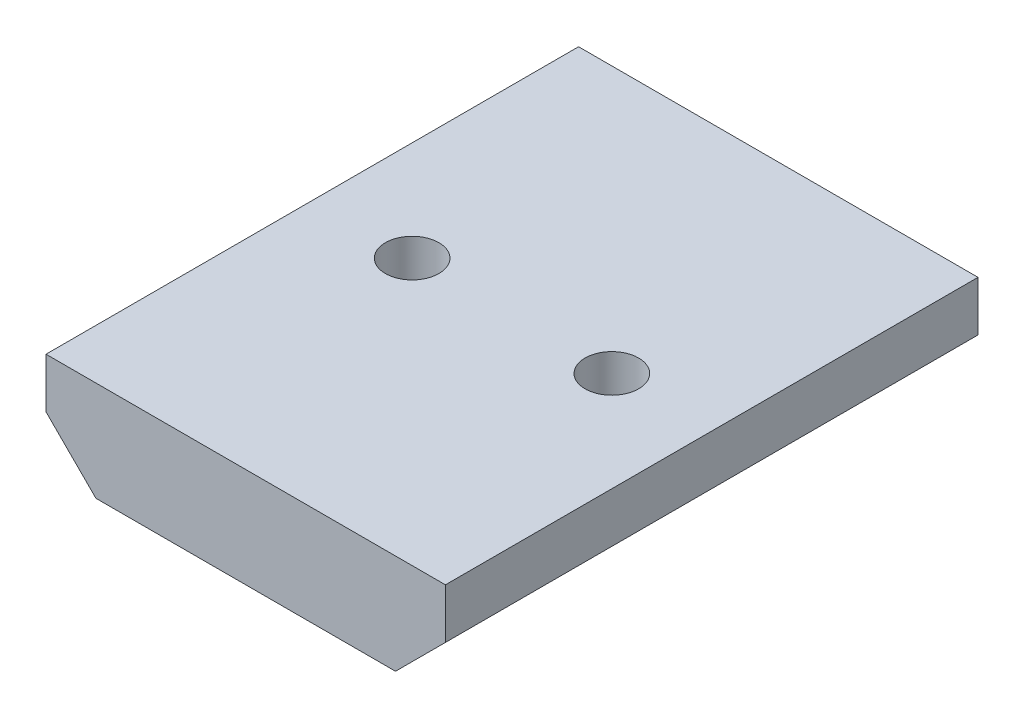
ISO-10303-21;
HEADER;
FILE_DESCRIPTION(('STEP AP214'),'2;1');
FILE_NAME('part.step','',(''),(''),'','','');
FILE_SCHEMA(('AUTOMOTIVE_DESIGN { 1 0 10303 214 1 1 1 1 }'));
ENDSEC;
DATA;
#1=APPLICATION_CONTEXT('core data for automotive mechanical design processes');
#2=APPLICATION_PROTOCOL_DEFINITION('international standard','automotive_design',2000,#1);
#3=PRODUCT_CONTEXT('',#1,'mechanical');
#4=PRODUCT('Part','Part','',(#3));
#5=PRODUCT_RELATED_PRODUCT_CATEGORY('part','',(#4));
#6=PRODUCT_DEFINITION_FORMATION('','',#4);
#7=PRODUCT_DEFINITION_CONTEXT('part definition',#1,'design');
#8=PRODUCT_DEFINITION('design','',#6,#7);
#9=PRODUCT_DEFINITION_SHAPE('','',#8);
#10=(LENGTH_UNIT() NAMED_UNIT(*) SI_UNIT(.MILLI.,.METRE.));
#11=(NAMED_UNIT(*) PLANE_ANGLE_UNIT() SI_UNIT($,.RADIAN.));
#12=(NAMED_UNIT(*) SI_UNIT($,.STERADIAN.) SOLID_ANGLE_UNIT());
#13=UNCERTAINTY_MEASURE_WITH_UNIT(LENGTH_MEASURE(1.E-05),#10,'distance_accuracy_value','');
#14=(GEOMETRIC_REPRESENTATION_CONTEXT(3) GLOBAL_UNCERTAINTY_ASSIGNED_CONTEXT((#13)) GLOBAL_UNIT_ASSIGNED_CONTEXT((#10,
#11,#12)) REPRESENTATION_CONTEXT('',''));
#15=CARTESIAN_POINT('',(0.,0.,0.));
#16=DIRECTION('',(0.,0.,1.));
#17=DIRECTION('',(1.,0.,0.));
#18=AXIS2_PLACEMENT_3D('',#15,#16,#17);
#19=CARTESIAN_POINT('',(19.05,4.7625,-25.4));
#20=DIRECTION('',(-1.,0.,0.));
#21=DIRECTION('',(0.,0.,1.));
#22=AXIS2_PLACEMENT_3D('',#19,#20,#21);
#23=PLANE('',#22);
#24=DIRECTION('',(0.,-1.,0.));
#25=VECTOR('',#24,1.);
#26=CARTESIAN_POINT('',(19.05,4.7625,25.4));
#27=LINE('',#26,#25);
#28=CARTESIAN_POINT('',(19.05,4.7625,25.4));
#29=VERTEX_POINT('',#28);
#30=CARTESIAN_POINT('',(19.05,0.,25.4));
#31=VERTEX_POINT('',#30);
#32=EDGE_CURVE('E140',#29,#31,#27,.T.);
#33=ORIENTED_EDGE('',*,*,#32,.T.);
#34=DIRECTION('',(0.,0.,-1.));
#35=VECTOR('',#34,1.);
#36=CARTESIAN_POINT('',(19.05,0.,-25.4));
#37=LINE('',#36,#35);
#38=CARTESIAN_POINT('',(19.05,0.,-25.4));
#39=VERTEX_POINT('',#38);
#40=EDGE_CURVE('E119',#31,#39,#37,.T.);
#41=ORIENTED_EDGE('',*,*,#40,.T.);
#42=DIRECTION('',(0.,-1.,0.));
#43=VECTOR('',#42,1.);
#44=CARTESIAN_POINT('',(19.05,4.7625,-25.4));
#45=LINE('',#44,#43);
#46=CARTESIAN_POINT('',(19.05,4.7625,-25.4));
#47=VERTEX_POINT('',#46);
#48=EDGE_CURVE('E100',#47,#39,#45,.T.);
#49=ORIENTED_EDGE('',*,*,#48,.F.);
#50=DIRECTION('',(0.,0.,-1.));
#51=VECTOR('',#50,1.);
#52=CARTESIAN_POINT('',(19.05,4.7625,-25.4));
#53=LINE('',#52,#51);
#54=EDGE_CURVE('E106',#29,#47,#53,.T.);
#55=ORIENTED_EDGE('',*,*,#54,.F.);
#56=EDGE_LOOP('',(#33,#41,#49,#55));
#57=FACE_BOUND('',#56,.T.);
#58=ADVANCED_FACE('F35',(#57),#23,.F.);
#59=CARTESIAN_POINT('',(-19.05,4.7625,-25.4));
#60=DIRECTION('',(0.,0.,1.));
#61=DIRECTION('',(1.,0.,0.));
#62=AXIS2_PLACEMENT_3D('',#59,#60,#61);
#63=PLANE('',#62);
#64=ORIENTED_EDGE('',*,*,#48,.T.);
#65=DIRECTION('',(0.707106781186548,0.707106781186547,0.));
#66=VECTOR('',#65,1.);
#67=CARTESIAN_POINT('',(19.05,0.,-25.4));
#68=LINE('',#67,#66);
#69=CARTESIAN_POINT('',(14.2874999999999,-4.7625,-25.4));
#70=VERTEX_POINT('',#69);
#71=EDGE_CURVE('E128',#39,#70,#68,.F.);
#72=ORIENTED_EDGE('',*,*,#71,.T.);
#73=DIRECTION('',(-1.,0.,0.));
#74=VECTOR('',#73,1.);
#75=CARTESIAN_POINT('',(-19.05,-4.7625,-25.4));
#76=LINE('',#75,#74);
#77=CARTESIAN_POINT('',(-14.2875,-4.7625,-25.4));
#78=VERTEX_POINT('',#77);
#79=EDGE_CURVE('E147',#70,#78,#76,.T.);
#80=ORIENTED_EDGE('',*,*,#79,.T.);
#81=DIRECTION('',(0.707106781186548,-0.707106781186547,0.));
#82=VECTOR('',#81,1.);
#83=CARTESIAN_POINT('',(-19.05,0.,-25.4));
#84=LINE('',#83,#82);
#85=CARTESIAN_POINT('',(-19.05,0.,-25.4));
#86=VERTEX_POINT('',#85);
#87=EDGE_CURVE('E121',#78,#86,#84,.F.);
#88=ORIENTED_EDGE('',*,*,#87,.T.);
#89=DIRECTION('',(0.,-1.,0.));
#90=VECTOR('',#89,1.);
#91=CARTESIAN_POINT('',(-19.05,4.7625,-25.4));
#92=LINE('',#91,#90);
#93=CARTESIAN_POINT('',(-19.05,4.7625,-25.4));
#94=VERTEX_POINT('',#93);
#95=EDGE_CURVE('E102',#94,#86,#92,.T.);
#96=ORIENTED_EDGE('',*,*,#95,.F.);
#97=DIRECTION('',(-1.,0.,0.));
#98=VECTOR('',#97,1.);
#99=CARTESIAN_POINT('',(-19.05,4.7625,-25.4));
#100=LINE('',#99,#98);
#101=EDGE_CURVE('E96',#47,#94,#100,.T.);
#102=ORIENTED_EDGE('',*,*,#101,.F.);
#103=EDGE_LOOP('',(#64,#72,#80,#88,#96,#102));
#104=FACE_BOUND('',#103,.T.);
#105=ADVANCED_FACE('F98',(#104),#63,.F.);
#106=CARTESIAN_POINT('',(-19.05,4.7625,-25.4));
#107=DIRECTION('',(1.,0.,0.));
#108=DIRECTION('',(0.,0.,-1.));
#109=AXIS2_PLACEMENT_3D('',#106,#107,#108);
#110=PLANE('',#109);
#111=ORIENTED_EDGE('',*,*,#95,.T.);
#112=DIRECTION('',(0.,0.,1.));
#113=VECTOR('',#112,1.);
#114=CARTESIAN_POINT('',(-19.05,0.,-25.4));
#115=LINE('',#114,#113);
#116=CARTESIAN_POINT('',(-19.05,0.,25.4));
#117=VERTEX_POINT('',#116);
#118=EDGE_CURVE('E11',#86,#117,#115,.T.);
#119=ORIENTED_EDGE('',*,*,#118,.T.);
#120=DIRECTION('',(0.,-1.,0.));
#121=VECTOR('',#120,1.);
#122=CARTESIAN_POINT('',(-19.05,4.7625,25.4));
#123=LINE('',#122,#121);
#124=CARTESIAN_POINT('',(-19.05,4.7625,25.4));
#125=VERTEX_POINT('',#124);
#126=EDGE_CURVE('E123',#125,#117,#123,.T.);
#127=ORIENTED_EDGE('',*,*,#126,.F.);
#128=DIRECTION('',(0.,0.,1.));
#129=VECTOR('',#128,1.);
#130=CARTESIAN_POINT('',(-19.05,4.7625,-25.4));
#131=LINE('',#130,#129);
#132=EDGE_CURVE('E105',#94,#125,#131,.T.);
#133=ORIENTED_EDGE('',*,*,#132,.F.);
#134=EDGE_LOOP('',(#111,#119,#127,#133));
#135=FACE_BOUND('',#134,.T.);
#136=ADVANCED_FACE('F164',(#135),#110,.F.);
#137=CARTESIAN_POINT('',(-19.05,4.7625,25.4));
#138=DIRECTION('',(0.,0.,-1.));
#139=DIRECTION('',(-1.,0.,0.));
#140=AXIS2_PLACEMENT_3D('',#137,#138,#139);
#141=PLANE('',#140);
#142=DIRECTION('',(1.,0.,0.));
#143=VECTOR('',#142,1.);
#144=CARTESIAN_POINT('',(-19.05,-4.7625,25.4));
#145=LINE('',#144,#143);
#146=CARTESIAN_POINT('',(-14.2875,-4.7625,25.4));
#147=VERTEX_POINT('',#146);
#148=CARTESIAN_POINT('',(14.2875,-4.7625,25.4));
#149=VERTEX_POINT('',#148);
#150=EDGE_CURVE('E115',#147,#149,#145,.T.);
#151=ORIENTED_EDGE('',*,*,#150,.T.);
#152=DIRECTION('',(-0.707106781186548,-0.707106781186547,0.));
#153=VECTOR('',#152,1.);
#154=CARTESIAN_POINT('',(19.05,0.,25.4));
#155=LINE('',#154,#153);
#156=EDGE_CURVE('E43',#149,#31,#155,.F.);
#157=ORIENTED_EDGE('',*,*,#156,.T.);
#158=ORIENTED_EDGE('',*,*,#32,.F.);
#159=DIRECTION('',(1.,0.,0.));
#160=VECTOR('',#159,1.);
#161=CARTESIAN_POINT('',(-19.05,4.7625,25.4));
#162=LINE('',#161,#160);
#163=EDGE_CURVE('E111',#125,#29,#162,.T.);
#164=ORIENTED_EDGE('',*,*,#163,.F.);
#165=ORIENTED_EDGE('',*,*,#126,.T.);
#166=DIRECTION('',(-0.707106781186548,0.707106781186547,0.));
#167=VECTOR('',#166,1.);
#168=CARTESIAN_POINT('',(-19.05,0.,25.4));
#169=LINE('',#168,#167);
#170=EDGE_CURVE('E50',#117,#147,#169,.F.);
#171=ORIENTED_EDGE('',*,*,#170,.T.);
#172=EDGE_LOOP('',(#151,#157,#158,#164,#165,#171));
#173=FACE_BOUND('',#172,.T.);
#174=ADVANCED_FACE('F139',(#173),#141,.F.);
#175=CARTESIAN_POINT('',(0.,4.7625,0.));
#176=DIRECTION('',(0.,1.,0.));
#177=DIRECTION('',(0.,0.,1.));
#178=AXIS2_PLACEMENT_3D('',#175,#176,#177);
#179=PLANE('',#178);
#180=CARTESIAN_POINT('',(9.525,4.7625,0.));
#181=DIRECTION('',(0.,-1.,0.));
#182=DIRECTION('',(0.,0.,-1.));
#183=AXIS2_PLACEMENT_3D('',#180,#181,#182);
#184=CIRCLE('',#183,2.5527);
#185=CARTESIAN_POINT('',(9.525,4.7625,-2.5527));
#186=VERTEX_POINT('',#185);
#187=EDGE_CURVE('E170',#186,#186,#184,.T.);
#188=ORIENTED_EDGE('',*,*,#187,.T.);
#189=EDGE_LOOP('',(#188));
#190=FACE_BOUND('',#189,.T.);
#191=CARTESIAN_POINT('',(-9.52499999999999,4.7625,0.));
#192=DIRECTION('',(0.,-1.,0.));
#193=DIRECTION('',(0.,0.,-1.));
#194=AXIS2_PLACEMENT_3D('',#191,#192,#193);
#195=CIRCLE('',#194,2.5527);
#196=CARTESIAN_POINT('',(-9.52499999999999,4.7625,-2.5527));
#197=VERTEX_POINT('',#196);
#198=EDGE_CURVE('E153',#197,#197,#195,.T.);
#199=ORIENTED_EDGE('',*,*,#198,.T.);
#200=EDGE_LOOP('',(#199));
#201=FACE_BOUND('',#200,.T.);
#202=ORIENTED_EDGE('',*,*,#54,.T.);
#203=ORIENTED_EDGE('',*,*,#101,.T.);
#204=ORIENTED_EDGE('',*,*,#132,.T.);
#205=ORIENTED_EDGE('',*,*,#163,.T.);
#206=EDGE_LOOP('',(#202,#203,#204,#205));
#207=FACE_BOUND('',#206,.T.);
#208=ADVANCED_FACE('F109',(#190,#201,#207),#179,.T.);
#209=CARTESIAN_POINT('',(0.,-4.7625,0.));
#210=DIRECTION('',(0.,1.,0.));
#211=DIRECTION('',(0.,0.,1.));
#212=AXIS2_PLACEMENT_3D('',#209,#210,#211);
#213=PLANE('',#212);
#214=ORIENTED_EDGE('',*,*,#79,.F.);
#215=DIRECTION('',(0.,0.,1.));
#216=VECTOR('',#215,1.);
#217=CARTESIAN_POINT('',(14.2875,-4.7625,0.));
#218=LINE('',#217,#216);
#219=CARTESIAN_POINT('',(14.2875,-4.7625,0.));
#220=VERTEX_POINT('',#219);
#221=EDGE_CURVE('E135',#70,#220,#218,.T.);
#222=ORIENTED_EDGE('',*,*,#221,.T.);
#223=CARTESIAN_POINT('',(9.525,-4.7625,0.));
#224=DIRECTION('',(0.,-1.,0.));
#225=DIRECTION('',(0.,0.,-1.));
#226=AXIS2_PLACEMENT_3D('',#223,#224,#225);
#227=CIRCLE('',#226,4.7625);
#228=EDGE_CURVE('E223',#220,#220,#227,.T.);
#229=ORIENTED_EDGE('',*,*,#228,.F.);
#230=DIRECTION('',(0.,0.,1.));
#231=VECTOR('',#230,1.);
#232=CARTESIAN_POINT('',(14.2875,-4.7625,0.));
#233=LINE('',#232,#231);
#234=EDGE_CURVE('E57',#220,#149,#233,.T.);
#235=ORIENTED_EDGE('',*,*,#234,.T.);
#236=ORIENTED_EDGE('',*,*,#150,.F.);
#237=DIRECTION('',(0.,0.,-1.));
#238=VECTOR('',#237,1.);
#239=CARTESIAN_POINT('',(-14.2875,-4.7625,0.));
#240=LINE('',#239,#238);
#241=CARTESIAN_POINT('',(-14.2875,-4.7625,0.));
#242=VERTEX_POINT('',#241);
#243=EDGE_CURVE('E132',#147,#242,#240,.T.);
#244=ORIENTED_EDGE('',*,*,#243,.T.);
#245=CARTESIAN_POINT('',(-9.52499999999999,-4.7625,0.));
#246=DIRECTION('',(0.,-1.,0.));
#247=DIRECTION('',(0.,0.,-1.));
#248=AXIS2_PLACEMENT_3D('',#245,#246,#247);
#249=CIRCLE('',#248,4.7625);
#250=EDGE_CURVE('E166',#242,#242,#249,.T.);
#251=ORIENTED_EDGE('',*,*,#250,.F.);
#252=DIRECTION('',(0.,0.,-1.));
#253=VECTOR('',#252,1.);
#254=CARTESIAN_POINT('',(-14.2875,-4.7625,0.));
#255=LINE('',#254,#253);
#256=EDGE_CURVE('E130',#242,#78,#255,.T.);
#257=ORIENTED_EDGE('',*,*,#256,.T.);
#258=EDGE_LOOP('',(#214,#222,#229,#235,#236,#244,#251,#257));
#259=FACE_BOUND('',#258,.T.);
#260=ADVANCED_FACE('F149',(#259),#213,.F.);
#261=CARTESIAN_POINT('',(-9.52499999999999,-4.7625,0.));
#262=DIRECTION('',(0.,-1.,0.));
#263=DIRECTION('',(0.,0.,-1.));
#264=AXIS2_PLACEMENT_3D('',#261,#262,#263);
#265=CYLINDRICAL_SURFACE('',#264,2.5527);
#266=ORIENTED_EDGE('',*,*,#198,.F.);
#267=EDGE_LOOP('',(#266));
#268=FACE_BOUND('',#267,.T.);
#269=CARTESIAN_POINT('',(-9.52499999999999,0.0634999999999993,0.));
#270=DIRECTION('',(0.,-1.,0.));
#271=DIRECTION('',(0.,0.,-1.));
#272=AXIS2_PLACEMENT_3D('',#269,#270,#271);
#273=CIRCLE('',#272,2.5527);
#274=CARTESIAN_POINT('',(-9.52499999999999,0.0634999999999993,-2.5527));
#275=VERTEX_POINT('',#274);
#276=EDGE_CURVE('E157',#275,#275,#273,.T.);
#277=ORIENTED_EDGE('',*,*,#276,.T.);
#278=EDGE_LOOP('',(#277));
#279=FACE_BOUND('',#278,.T.);
#280=ADVANCED_FACE('F182',(#268,#279),#265,.F.);
#281=CARTESIAN_POINT('',(-6.97229999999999,0.0634999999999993,0.));
#282=DIRECTION('',(0.,1.,0.));
#283=DIRECTION('',(0.,0.,1.));
#284=AXIS2_PLACEMENT_3D('',#281,#282,#283);
#285=PLANE('',#284);
#286=ORIENTED_EDGE('',*,*,#276,.F.);
#287=EDGE_LOOP('',(#286));
#288=FACE_BOUND('',#287,.T.);
#289=CARTESIAN_POINT('',(-9.52499999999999,0.0634999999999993,0.));
#290=DIRECTION('',(0.,-1.,0.));
#291=DIRECTION('',(0.,0.,-1.));
#292=AXIS2_PLACEMENT_3D('',#289,#290,#291);
#293=CIRCLE('',#292,4.7625);
#294=CARTESIAN_POINT('',(-9.52499999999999,0.0634999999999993,-4.7625));
#295=VERTEX_POINT('',#294);
#296=EDGE_CURVE('E169',#295,#295,#293,.T.);
#297=ORIENTED_EDGE('',*,*,#296,.T.);
#298=EDGE_LOOP('',(#297));
#299=FACE_BOUND('',#298,.T.);
#300=ADVANCED_FACE('F184',(#288,#299),#285,.F.);
#301=CARTESIAN_POINT('',(-9.52499999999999,-4.7625,0.));
#302=DIRECTION('',(0.,-1.,0.));
#303=DIRECTION('',(0.,0.,-1.));
#304=AXIS2_PLACEMENT_3D('',#301,#302,#303);
#305=CYLINDRICAL_SURFACE('',#304,4.7625);
#306=ORIENTED_EDGE('',*,*,#296,.F.);
#307=EDGE_LOOP('',(#306));
#308=FACE_BOUND('',#307,.T.);
#309=ORIENTED_EDGE('',*,*,#250,.T.);
#310=EDGE_LOOP('',(#309));
#311=FACE_BOUND('',#310,.T.);
#312=ADVANCED_FACE('F168',(#308,#311),#305,.F.);
#313=CARTESIAN_POINT('',(9.525,-4.7625,0.));
#314=DIRECTION('',(0.,-1.,0.));
#315=DIRECTION('',(0.,0.,-1.));
#316=AXIS2_PLACEMENT_3D('',#313,#314,#315);
#317=CYLINDRICAL_SURFACE('',#316,2.5527);
#318=ORIENTED_EDGE('',*,*,#187,.F.);
#319=EDGE_LOOP('',(#318));
#320=FACE_BOUND('',#319,.T.);
#321=CARTESIAN_POINT('',(9.525,0.0634999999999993,0.));
#322=DIRECTION('',(0.,-1.,0.));
#323=DIRECTION('',(0.,0.,-1.));
#324=AXIS2_PLACEMENT_3D('',#321,#322,#323);
#325=CIRCLE('',#324,2.5527);
#326=CARTESIAN_POINT('',(9.525,0.0634999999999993,-2.5527));
#327=VERTEX_POINT('',#326);
#328=EDGE_CURVE('E175',#327,#327,#325,.T.);
#329=ORIENTED_EDGE('',*,*,#328,.T.);
#330=EDGE_LOOP('',(#329));
#331=FACE_BOUND('',#330,.T.);
#332=ADVANCED_FACE('F191',(#320,#331),#317,.F.);
#333=CARTESIAN_POINT('',(12.0777,0.0634999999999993,0.));
#334=DIRECTION('',(0.,1.,0.));
#335=DIRECTION('',(0.,0.,1.));
#336=AXIS2_PLACEMENT_3D('',#333,#334,#335);
#337=PLANE('',#336);
#338=ORIENTED_EDGE('',*,*,#328,.F.);
#339=EDGE_LOOP('',(#338));
#340=FACE_BOUND('',#339,.T.);
#341=CARTESIAN_POINT('',(9.525,0.0634999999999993,0.));
#342=DIRECTION('',(0.,-1.,0.));
#343=DIRECTION('',(0.,0.,-1.));
#344=AXIS2_PLACEMENT_3D('',#341,#342,#343);
#345=CIRCLE('',#344,4.7625);
#346=CARTESIAN_POINT('',(9.525,0.0634999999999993,-4.7625));
#347=VERTEX_POINT('',#346);
#348=EDGE_CURVE('E222',#347,#347,#345,.T.);
#349=ORIENTED_EDGE('',*,*,#348,.T.);
#350=EDGE_LOOP('',(#349));
#351=FACE_BOUND('',#350,.T.);
#352=ADVANCED_FACE('F196',(#340,#351),#337,.F.);
#353=CARTESIAN_POINT('',(9.525,-4.7625,0.));
#354=DIRECTION('',(0.,-1.,0.));
#355=DIRECTION('',(0.,0.,-1.));
#356=AXIS2_PLACEMENT_3D('',#353,#354,#355);
#357=CYLINDRICAL_SURFACE('',#356,4.7625);
#358=ORIENTED_EDGE('',*,*,#348,.F.);
#359=EDGE_LOOP('',(#358));
#360=FACE_BOUND('',#359,.T.);
#361=ORIENTED_EDGE('',*,*,#228,.T.);
#362=EDGE_LOOP('',(#361));
#363=FACE_BOUND('',#362,.T.);
#364=ADVANCED_FACE('F207',(#360,#363),#357,.F.);
#365=CARTESIAN_POINT('',(19.05,0.,-25.4));
#366=DIRECTION('',(-0.707106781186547,0.707106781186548,0.));
#367=DIRECTION('',(0.,0.,-1.));
#368=AXIS2_PLACEMENT_3D('',#365,#366,#367);
#369=PLANE('',#368);
#370=ORIENTED_EDGE('',*,*,#234,.F.);
#371=ORIENTED_EDGE('',*,*,#221,.F.);
#372=ORIENTED_EDGE('',*,*,#71,.F.);
#373=ORIENTED_EDGE('',*,*,#40,.F.);
#374=ORIENTED_EDGE('',*,*,#156,.F.);
#375=EDGE_LOOP('',(#370,#371,#372,#373,#374));
#376=FACE_BOUND('',#375,.T.);
#377=ADVANCED_FACE('F143',(#376),#369,.F.);
#378=CARTESIAN_POINT('',(-19.05,0.,-25.4));
#379=DIRECTION('',(0.707106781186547,0.707106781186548,0.));
#380=DIRECTION('',(0.,0.,1.));
#381=AXIS2_PLACEMENT_3D('',#378,#379,#380);
#382=PLANE('',#381);
#383=ORIENTED_EDGE('',*,*,#256,.F.);
#384=ORIENTED_EDGE('',*,*,#243,.F.);
#385=ORIENTED_EDGE('',*,*,#170,.F.);
#386=ORIENTED_EDGE('',*,*,#118,.F.);
#387=ORIENTED_EDGE('',*,*,#87,.F.);
#388=EDGE_LOOP('',(#383,#384,#385,#386,#387));
#389=FACE_BOUND('',#388,.T.);
#390=ADVANCED_FACE('F37',(#389),#382,.F.);
#391=CLOSED_SHELL('',(#58,#105,#136,#174,#208,#260,#280,#300,#312,#332,#352,#364,#377,#390));
#392=MANIFOLD_SOLID_BREP('B2',#391);
#393=ADVANCED_BREP_SHAPE_REPRESENTATION('',(#18,#392),#14);
#394=SHAPE_DEFINITION_REPRESENTATION(#9,#393);
ENDSEC;
END-ISO-10303-21;
